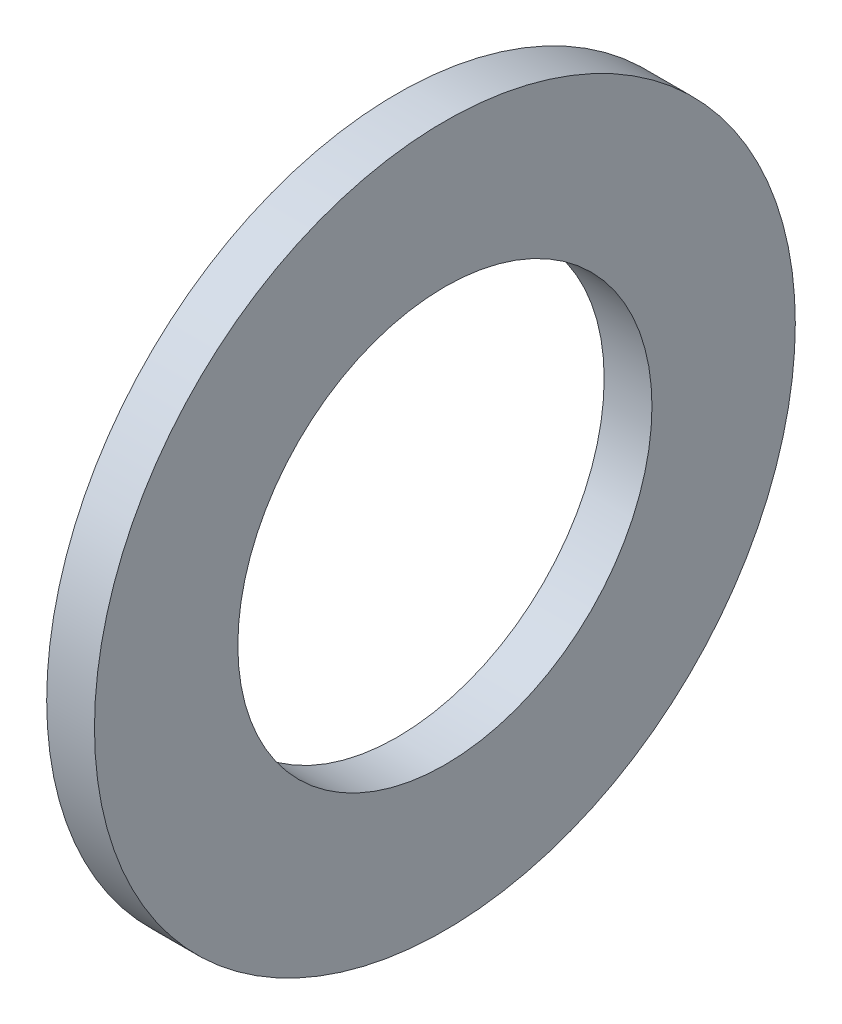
ISO-10303-21;
HEADER;
FILE_DESCRIPTION(('STEP AP214'),'2;1');
FILE_NAME('part.step','',(''),(''),'','','');
FILE_SCHEMA(('AUTOMOTIVE_DESIGN { 1 0 10303 214 1 1 1 1 }'));
ENDSEC;
DATA;
#1=APPLICATION_CONTEXT('core data for automotive mechanical design processes');
#2=APPLICATION_PROTOCOL_DEFINITION('international standard','automotive_design',2000,#1);
#3=PRODUCT_CONTEXT('',#1,'mechanical');
#4=PRODUCT('Part','Part','',(#3));
#5=PRODUCT_RELATED_PRODUCT_CATEGORY('part','',(#4));
#6=PRODUCT_DEFINITION_FORMATION('','',#4);
#7=PRODUCT_DEFINITION_CONTEXT('part definition',#1,'design');
#8=PRODUCT_DEFINITION('design','',#6,#7);
#9=PRODUCT_DEFINITION_SHAPE('','',#8);
#10=(LENGTH_UNIT() NAMED_UNIT(*) SI_UNIT(.MILLI.,.METRE.));
#11=(NAMED_UNIT(*) PLANE_ANGLE_UNIT() SI_UNIT($,.RADIAN.));
#12=(NAMED_UNIT(*) SI_UNIT($,.STERADIAN.) SOLID_ANGLE_UNIT());
#13=UNCERTAINTY_MEASURE_WITH_UNIT(LENGTH_MEASURE(1.E-05),#10,'distance_accuracy_value','');
#14=(GEOMETRIC_REPRESENTATION_CONTEXT(3) GLOBAL_UNCERTAINTY_ASSIGNED_CONTEXT((#13)) GLOBAL_UNIT_ASSIGNED_CONTEXT((#10,
#11,#12)) REPRESENTATION_CONTEXT('',''));
#15=CARTESIAN_POINT('',(0.,0.,0.));
#16=DIRECTION('',(0.,0.,1.));
#17=DIRECTION('',(1.,0.,0.));
#18=AXIS2_PLACEMENT_3D('',#15,#16,#17);
#19=CARTESIAN_POINT('',(0.,0.,-11.));
#20=DIRECTION('',(1.,0.,0.));
#21=DIRECTION('',(0.,0.,-1.));
#22=AXIS2_PLACEMENT_3D('',#19,#20,#21);
#23=PLANE('',#22);
#24=CARTESIAN_POINT('',(0.,0.,0.));
#25=DIRECTION('',(-1.,0.,0.));
#26=DIRECTION('',(0.,0.,1.));
#27=AXIS2_PLACEMENT_3D('',#24,#25,#26);
#28=CIRCLE('',#27,6.5);
#29=CARTESIAN_POINT('',(0.,0.,6.5));
#30=VERTEX_POINT('',#29);
#31=EDGE_CURVE('E10',#30,#30,#28,.T.);
#32=ORIENTED_EDGE('',*,*,#31,.F.);
#33=EDGE_LOOP('',(#32));
#34=FACE_BOUND('',#33,.T.);
#35=CARTESIAN_POINT('',(0.,0.,0.));
#36=DIRECTION('',(-1.,0.,0.));
#37=DIRECTION('',(0.,0.,1.));
#38=AXIS2_PLACEMENT_3D('',#35,#36,#37);
#39=CIRCLE('',#38,11.);
#40=CARTESIAN_POINT('',(0.,0.,11.));
#41=VERTEX_POINT('',#40);
#42=EDGE_CURVE('E41',#41,#41,#39,.T.);
#43=ORIENTED_EDGE('',*,*,#42,.T.);
#44=EDGE_LOOP('',(#43));
#45=FACE_BOUND('',#44,.T.);
#46=ADVANCED_FACE('F27',(#34,#45),#23,.F.);
#47=CARTESIAN_POINT('',(0.,0.,0.));
#48=DIRECTION('',(-1.,0.,0.));
#49=DIRECTION('',(0.,0.,1.));
#50=AXIS2_PLACEMENT_3D('',#47,#48,#49);
#51=CYLINDRICAL_SURFACE('',#50,6.5);
#52=CARTESIAN_POINT('',(1.5,0.,0.));
#53=DIRECTION('',(-1.,0.,0.));
#54=DIRECTION('',(0.,0.,1.));
#55=AXIS2_PLACEMENT_3D('',#52,#53,#54);
#56=CIRCLE('',#55,6.5);
#57=CARTESIAN_POINT('',(1.5,0.,6.5));
#58=VERTEX_POINT('',#57);
#59=EDGE_CURVE('E33',#58,#58,#56,.T.);
#60=ORIENTED_EDGE('',*,*,#59,.F.);
#61=EDGE_LOOP('',(#60));
#62=FACE_BOUND('',#61,.T.);
#63=ORIENTED_EDGE('',*,*,#31,.T.);
#64=EDGE_LOOP('',(#63));
#65=FACE_BOUND('',#64,.T.);
#66=ADVANCED_FACE('F56',(#62,#65),#51,.F.);
#67=CARTESIAN_POINT('',(1.5,0.,-11.));
#68=DIRECTION('',(-1.,0.,0.));
#69=DIRECTION('',(0.,0.,1.));
#70=AXIS2_PLACEMENT_3D('',#67,#68,#69);
#71=PLANE('',#70);
#72=CARTESIAN_POINT('',(1.5,0.,0.));
#73=DIRECTION('',(-1.,0.,0.));
#74=DIRECTION('',(0.,0.,1.));
#75=AXIS2_PLACEMENT_3D('',#72,#73,#74);
#76=CIRCLE('',#75,11.);
#77=CARTESIAN_POINT('',(1.5,0.,11.));
#78=VERTEX_POINT('',#77);
#79=EDGE_CURVE('E37',#78,#78,#76,.T.);
#80=ORIENTED_EDGE('',*,*,#79,.F.);
#81=EDGE_LOOP('',(#80));
#82=FACE_BOUND('',#81,.T.);
#83=ORIENTED_EDGE('',*,*,#59,.T.);
#84=EDGE_LOOP('',(#83));
#85=FACE_BOUND('',#84,.T.);
#86=ADVANCED_FACE('F51',(#82,#85),#71,.F.);
#87=CARTESIAN_POINT('',(0.,0.,0.));
#88=DIRECTION('',(-1.,0.,0.));
#89=DIRECTION('',(0.,0.,1.));
#90=AXIS2_PLACEMENT_3D('',#87,#88,#89);
#91=CYLINDRICAL_SURFACE('',#90,11.);
#92=ORIENTED_EDGE('',*,*,#42,.F.);
#93=EDGE_LOOP('',(#92));
#94=FACE_BOUND('',#93,.T.);
#95=ORIENTED_EDGE('',*,*,#79,.T.);
#96=EDGE_LOOP('',(#95));
#97=FACE_BOUND('',#96,.T.);
#98=ADVANCED_FACE('F48',(#94,#97),#91,.T.);
#99=CLOSED_SHELL('',(#46,#66,#86,#98));
#100=MANIFOLD_SOLID_BREP('B2',#99);
#101=ADVANCED_BREP_SHAPE_REPRESENTATION('',(#18,#100),#14);
#102=SHAPE_DEFINITION_REPRESENTATION(#9,#101);
ENDSEC;
END-ISO-10303-21;
